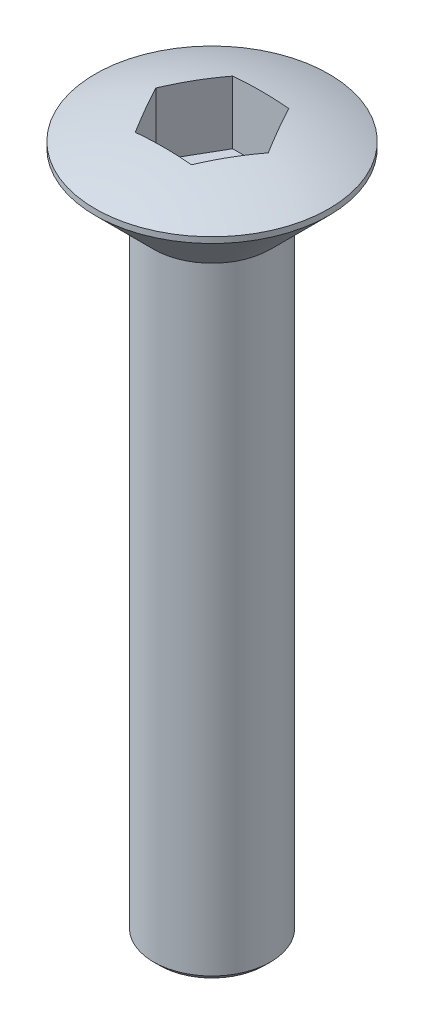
from build123d import *

# Parameters (mm, degrees)
ENL_V_MAT_EXTRU_1_DEPTH      = 37.013886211
ENL_V_MAT_EXTRU_1_DEPTH_BACK = 2


with BuildPart() as part:
    # Esquisse1 → R_volution2 (revolve)
    with BuildSketch(Plane.XY):
        with BuildLine():
            Line((0, -35), (0, 1.5))
            ThreePointArc((0, 1.5), (3.059411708, 1.197058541), (6, 0.3))
            Line((6, 0.3), (6, 0))
            Line((6, 0), (3, -3))
            Line((3, -3), (3, -34.7))
            Line((3, -34.7), (2.7, -35))
            Line((2.7, -35), (0, -35))
        make_face()
    revolve(axis=Axis((0, -35, 0), (0, 1, 0)))

    # Esquisse2 → Enl_v. mat.-Extru.1 (cut, two sides: drawn at the far end of the back side and taken through both)
    with BuildSketch(Plane(origin=(0, 0, 0), x_dir=(1, 0, 0), z_dir=(0, 1, 0)).offset(-ENL_V_MAT_EXTRU_1_DEPTH_BACK)):
        Polygon((-1.443375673, -2.5), (1.443375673, -2.5), (2.886751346, 0), (1.443375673, 2.5), (-1.443375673, 2.5), (-2.886751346, 0), align=None)
    extrude(amount=ENL_V_MAT_EXTRU_1_DEPTH + ENL_V_MAT_EXTRU_1_DEPTH_BACK, mode=Mode.SUBTRACT)


solid = part.part
